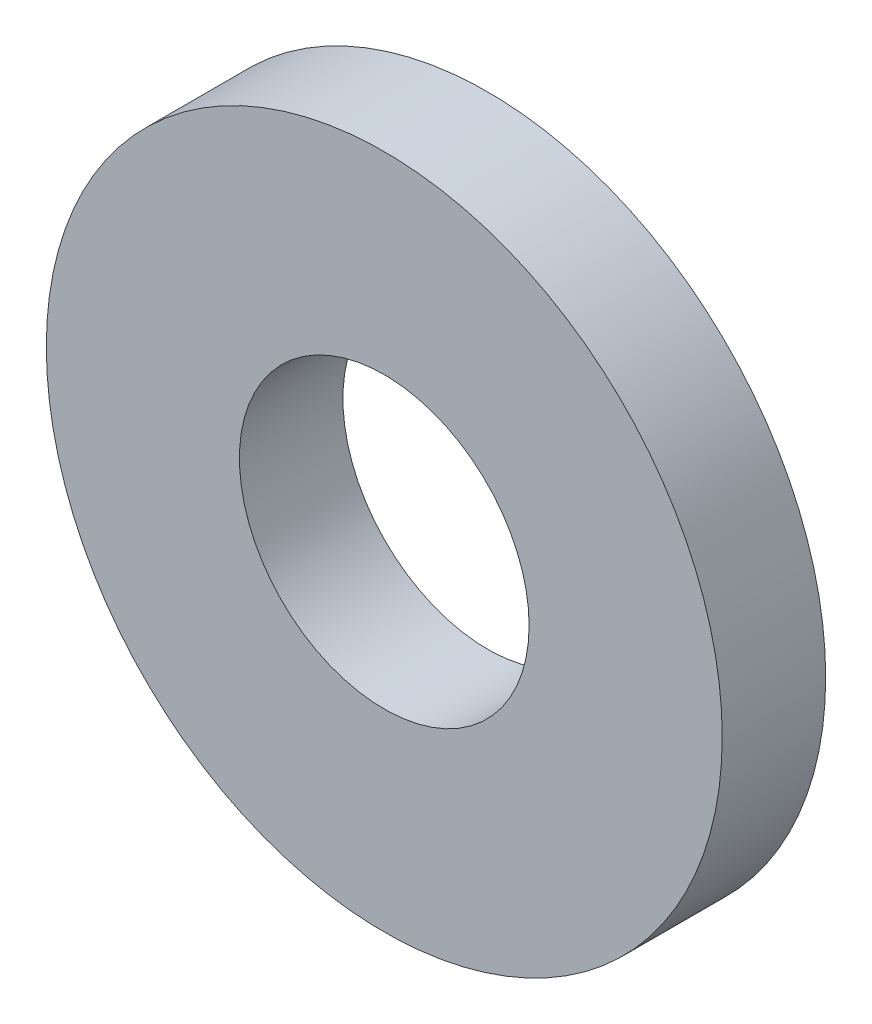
ISO-10303-21;
HEADER;
FILE_DESCRIPTION(('STEP AP214'),'2;1');
FILE_NAME('part.step','',(''),(''),'','','');
FILE_SCHEMA(('AUTOMOTIVE_DESIGN { 1 0 10303 214 1 1 1 1 }'));
ENDSEC;
DATA;
#1=APPLICATION_CONTEXT('core data for automotive mechanical design processes');
#2=APPLICATION_PROTOCOL_DEFINITION('international standard','automotive_design',2000,#1);
#3=PRODUCT_CONTEXT('',#1,'mechanical');
#4=PRODUCT('Part','Part','',(#3));
#5=PRODUCT_RELATED_PRODUCT_CATEGORY('part','',(#4));
#6=PRODUCT_DEFINITION_FORMATION('','',#4);
#7=PRODUCT_DEFINITION_CONTEXT('part definition',#1,'design');
#8=PRODUCT_DEFINITION('design','',#6,#7);
#9=PRODUCT_DEFINITION_SHAPE('','',#8);
#10=(LENGTH_UNIT() NAMED_UNIT(*) SI_UNIT(.MILLI.,.METRE.));
#11=(NAMED_UNIT(*) PLANE_ANGLE_UNIT() SI_UNIT($,.RADIAN.));
#12=(NAMED_UNIT(*) SI_UNIT($,.STERADIAN.) SOLID_ANGLE_UNIT());
#13=UNCERTAINTY_MEASURE_WITH_UNIT(LENGTH_MEASURE(1.E-05),#10,'distance_accuracy_value','');
#14=(GEOMETRIC_REPRESENTATION_CONTEXT(3) GLOBAL_UNCERTAINTY_ASSIGNED_CONTEXT((#13)) GLOBAL_UNIT_ASSIGNED_CONTEXT((#10,
#11,#12)) REPRESENTATION_CONTEXT('',''));
#15=CARTESIAN_POINT('',(0.,0.,0.));
#16=DIRECTION('',(0.,0.,1.));
#17=DIRECTION('',(1.,0.,0.));
#18=AXIS2_PLACEMENT_3D('',#15,#16,#17);
#19=CARTESIAN_POINT('',(0.,0.,3.75));
#20=DIRECTION('',(0.,0.,-1.));
#21=DIRECTION('',(-1.,0.,0.));
#22=AXIS2_PLACEMENT_3D('',#19,#20,#21);
#23=CYLINDRICAL_SURFACE('',#22,5.25);
#24=CARTESIAN_POINT('',(0.,0.,3.75));
#25=DIRECTION('',(0.,0.,1.));
#26=DIRECTION('',(1.,0.,0.));
#27=AXIS2_PLACEMENT_3D('',#24,#25,#26);
#28=CIRCLE('',#27,5.25);
#29=CARTESIAN_POINT('',(5.25,0.,3.75));
#30=VERTEX_POINT('',#29);
#31=EDGE_CURVE('E37',#30,#30,#28,.T.);
#32=ORIENTED_EDGE('',*,*,#31,.T.);
#33=EDGE_LOOP('',(#32));
#34=FACE_BOUND('',#33,.T.);
#35=CARTESIAN_POINT('',(0.,0.,0.));
#36=DIRECTION('',(0.,0.,1.));
#37=DIRECTION('',(1.,0.,0.));
#38=AXIS2_PLACEMENT_3D('',#35,#36,#37);
#39=CIRCLE('',#38,5.25);
#40=CARTESIAN_POINT('',(5.25,0.,0.));
#41=VERTEX_POINT('',#40);
#42=EDGE_CURVE('E43',#41,#41,#39,.T.);
#43=ORIENTED_EDGE('',*,*,#42,.F.);
#44=EDGE_LOOP('',(#43));
#45=FACE_BOUND('',#44,.T.);
#46=ADVANCED_FACE('F30',(#34,#45),#23,.F.);
#47=CARTESIAN_POINT('',(0.,0.,3.75));
#48=DIRECTION('',(0.,0.,-1.));
#49=DIRECTION('',(-1.,0.,0.));
#50=AXIS2_PLACEMENT_3D('',#47,#48,#49);
#51=CYLINDRICAL_SURFACE('',#50,12.25);
#52=CARTESIAN_POINT('',(0.,0.,3.75));
#53=DIRECTION('',(0.,0.,1.));
#54=DIRECTION('',(1.,0.,0.));
#55=AXIS2_PLACEMENT_3D('',#52,#53,#54);
#56=CIRCLE('',#55,12.25);
#57=CARTESIAN_POINT('',(12.25,0.,3.75));
#58=VERTEX_POINT('',#57);
#59=EDGE_CURVE('E10',#58,#58,#56,.T.);
#60=ORIENTED_EDGE('',*,*,#59,.F.);
#61=EDGE_LOOP('',(#60));
#62=FACE_BOUND('',#61,.T.);
#63=CARTESIAN_POINT('',(0.,0.,0.));
#64=DIRECTION('',(0.,0.,1.));
#65=DIRECTION('',(1.,0.,0.));
#66=AXIS2_PLACEMENT_3D('',#63,#64,#65);
#67=CIRCLE('',#66,12.25);
#68=CARTESIAN_POINT('',(12.25,0.,0.));
#69=VERTEX_POINT('',#68);
#70=EDGE_CURVE('E33',#69,#69,#67,.T.);
#71=ORIENTED_EDGE('',*,*,#70,.T.);
#72=EDGE_LOOP('',(#71));
#73=FACE_BOUND('',#72,.T.);
#74=ADVANCED_FACE('F50',(#62,#73),#51,.T.);
#75=CARTESIAN_POINT('',(0.,0.,3.75));
#76=DIRECTION('',(0.,0.,1.));
#77=DIRECTION('',(1.,0.,0.));
#78=AXIS2_PLACEMENT_3D('',#75,#76,#77);
#79=PLANE('',#78);
#80=ORIENTED_EDGE('',*,*,#31,.F.);
#81=EDGE_LOOP('',(#80));
#82=FACE_BOUND('',#81,.T.);
#83=ORIENTED_EDGE('',*,*,#59,.T.);
#84=EDGE_LOOP('',(#83));
#85=FACE_BOUND('',#84,.T.);
#86=ADVANCED_FACE('F54',(#82,#85),#79,.T.);
#87=CARTESIAN_POINT('',(0.,0.,0.));
#88=DIRECTION('',(0.,0.,1.));
#89=DIRECTION('',(1.,0.,0.));
#90=AXIS2_PLACEMENT_3D('',#87,#88,#89);
#91=PLANE('',#90);
#92=ORIENTED_EDGE('',*,*,#42,.T.);
#93=EDGE_LOOP('',(#92));
#94=FACE_BOUND('',#93,.T.);
#95=ORIENTED_EDGE('',*,*,#70,.F.);
#96=EDGE_LOOP('',(#95));
#97=FACE_BOUND('',#96,.T.);
#98=ADVANCED_FACE('F52',(#94,#97),#91,.F.);
#99=CLOSED_SHELL('',(#46,#74,#86,#98));
#100=MANIFOLD_SOLID_BREP('B2',#99);
#101=ADVANCED_BREP_SHAPE_REPRESENTATION('',(#18,#100),#14);
#102=SHAPE_DEFINITION_REPRESENTATION(#9,#101);
ENDSEC;
END-ISO-10303-21;
